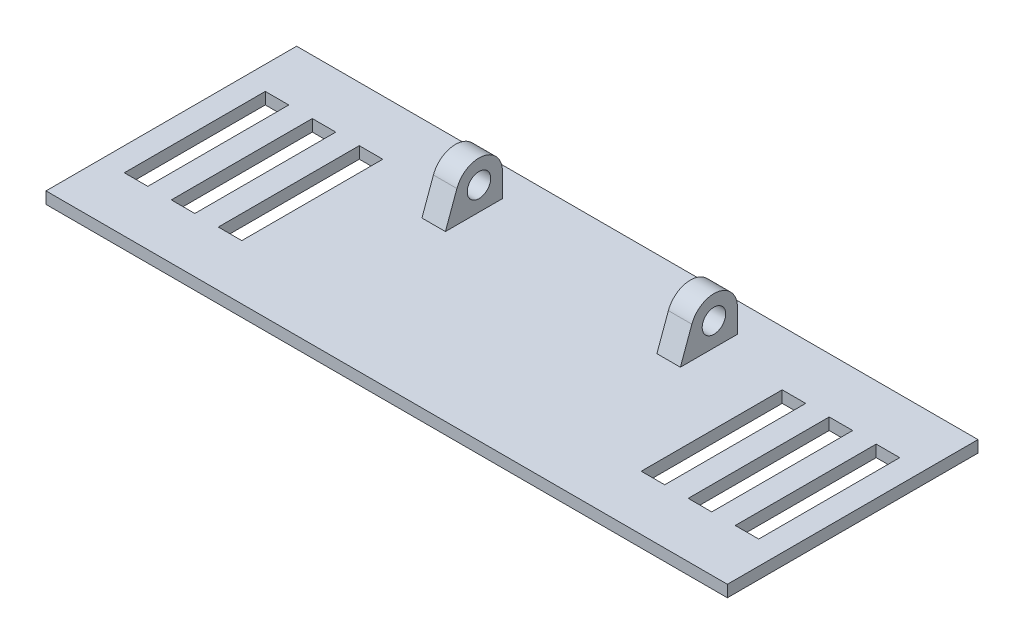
ISO-10303-21;
HEADER;
FILE_DESCRIPTION(('STEP AP214'),'2;1');
FILE_NAME('part.step','',(''),(''),'','','');
FILE_SCHEMA(('AUTOMOTIVE_DESIGN { 1 0 10303 214 1 1 1 1 }'));
ENDSEC;
DATA;
#1=APPLICATION_CONTEXT('core data for automotive mechanical design processes');
#2=APPLICATION_PROTOCOL_DEFINITION('international standard','automotive_design',2000,#1);
#3=PRODUCT_CONTEXT('',#1,'mechanical');
#4=PRODUCT('Part','Part','',(#3));
#5=PRODUCT_RELATED_PRODUCT_CATEGORY('part','',(#4));
#6=PRODUCT_DEFINITION_FORMATION('','',#4);
#7=PRODUCT_DEFINITION_CONTEXT('part definition',#1,'design');
#8=PRODUCT_DEFINITION('design','',#6,#7);
#9=PRODUCT_DEFINITION_SHAPE('','',#8);
#10=(LENGTH_UNIT() NAMED_UNIT(*) SI_UNIT(.MILLI.,.METRE.));
#11=(NAMED_UNIT(*) PLANE_ANGLE_UNIT() SI_UNIT($,.RADIAN.));
#12=(NAMED_UNIT(*) SI_UNIT($,.STERADIAN.) SOLID_ANGLE_UNIT());
#13=UNCERTAINTY_MEASURE_WITH_UNIT(LENGTH_MEASURE(1.E-05),#10,'distance_accuracy_value','');
#14=(GEOMETRIC_REPRESENTATION_CONTEXT(3) GLOBAL_UNCERTAINTY_ASSIGNED_CONTEXT((#13)) GLOBAL_UNIT_ASSIGNED_CONTEXT((#10,
#11,#12)) REPRESENTATION_CONTEXT('',''));
#15=CARTESIAN_POINT('',(0.,0.,0.));
#16=DIRECTION('',(0.,0.,1.));
#17=DIRECTION('',(1.,0.,0.));
#18=AXIS2_PLACEMENT_3D('',#15,#16,#17);
#19=CARTESIAN_POINT('',(13.5,21.5,-9.28381183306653));
#20=DIRECTION('',(-1.,0.,0.));
#21=DIRECTION('',(0.,0.,-1.));
#22=AXIS2_PLACEMENT_3D('',#19,#20,#21);
#23=PLANE('',#22);
#24=CARTESIAN_POINT('',(13.5,21.5,-9.28381183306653));
#25=DIRECTION('',(1.,0.,0.));
#26=DIRECTION('',(0.,0.,-1.));
#27=AXIS2_PLACEMENT_3D('',#24,#25,#26);
#28=CIRCLE('',#27,3.);
#29=CARTESIAN_POINT('',(13.5,21.5,-12.2838118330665));
#30=VERTEX_POINT('',#29);
#31=CARTESIAN_POINT('',(13.5,22.526060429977,-6.46473397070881));
#32=VERTEX_POINT('',#31);
#33=EDGE_CURVE('E274',#30,#32,#28,.T.);
#34=ORIENTED_EDGE('',*,*,#33,.F.);
#35=DIRECTION('',(0.,1.,0.));
#36=VECTOR('',#35,1.);
#37=CARTESIAN_POINT('',(13.5,21.5,-12.2838118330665));
#38=LINE('',#37,#36);
#39=CARTESIAN_POINT('',(13.5,18.5,-12.2838118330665));
#40=VERTEX_POINT('',#39);
#41=EDGE_CURVE('E286',#40,#30,#38,.T.);
#42=ORIENTED_EDGE('',*,*,#41,.F.);
#43=DIRECTION('',(0.,0.,-1.));
#44=VECTOR('',#43,1.);
#45=CARTESIAN_POINT('',(13.5,18.5,-4.99936781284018));
#46=LINE('',#45,#44);
#47=CARTESIAN_POINT('',(13.5,18.5,-4.99936781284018));
#48=VERTEX_POINT('',#47);
#49=EDGE_CURVE('E293',#48,#40,#46,.T.);
#50=ORIENTED_EDGE('',*,*,#49,.F.);
#51=DIRECTION('',(0.,-0.939692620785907,0.342020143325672));
#52=VECTOR('',#51,1.);
#53=CARTESIAN_POINT('',(13.5,22.526060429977,-6.46473397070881));
#54=LINE('',#53,#52);
#55=EDGE_CURVE('E289',#32,#48,#54,.T.);
#56=ORIENTED_EDGE('',*,*,#55,.F.);
#57=EDGE_LOOP('',(#34,#42,#50,#56));
#58=FACE_BOUND('',#57,.T.);
#59=CARTESIAN_POINT('',(13.5,21.5,-9.28381183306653));
#60=DIRECTION('',(1.,0.,0.));
#61=DIRECTION('',(0.,0.,-1.));
#62=AXIS2_PLACEMENT_3D('',#59,#60,#61);
#63=CIRCLE('',#62,1.5);
#64=CARTESIAN_POINT('',(13.5,21.5,-10.7838118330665));
#65=VERTEX_POINT('',#64);
#66=EDGE_CURVE('E302',#65,#65,#63,.T.);
#67=ORIENTED_EDGE('',*,*,#66,.T.);
#68=EDGE_LOOP('',(#67));
#69=FACE_BOUND('',#68,.T.);
#70=ADVANCED_FACE('F35',(#58,#69),#23,.T.);
#71=CARTESIAN_POINT('',(16.5,21.5,-9.28381183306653));
#72=DIRECTION('',(-1.,0.,0.));
#73=DIRECTION('',(0.,0.,-1.));
#74=AXIS2_PLACEMENT_3D('',#71,#72,#73);
#75=PLANE('',#74);
#76=CARTESIAN_POINT('',(16.5,21.5,-9.28381183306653));
#77=DIRECTION('',(1.,0.,0.));
#78=DIRECTION('',(0.,0.,-1.));
#79=AXIS2_PLACEMENT_3D('',#76,#77,#78);
#80=CIRCLE('',#79,3.);
#81=CARTESIAN_POINT('',(16.5,21.5,-12.2838118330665));
#82=VERTEX_POINT('',#81);
#83=CARTESIAN_POINT('',(16.5,22.526060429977,-6.46473397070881));
#84=VERTEX_POINT('',#83);
#85=EDGE_CURVE('E276',#82,#84,#80,.T.);
#86=ORIENTED_EDGE('',*,*,#85,.T.);
#87=DIRECTION('',(0.,-0.939692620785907,0.342020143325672));
#88=VECTOR('',#87,1.);
#89=CARTESIAN_POINT('',(16.5,22.526060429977,-6.46473397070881));
#90=LINE('',#89,#88);
#91=CARTESIAN_POINT('',(16.5,18.5,-4.99936781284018));
#92=VERTEX_POINT('',#91);
#93=EDGE_CURVE('E50',#84,#92,#90,.T.);
#94=ORIENTED_EDGE('',*,*,#93,.T.);
#95=DIRECTION('',(0.,0.,-1.));
#96=VECTOR('',#95,1.);
#97=CARTESIAN_POINT('',(16.5,18.5,-4.99936781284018));
#98=LINE('',#97,#96);
#99=CARTESIAN_POINT('',(16.5,18.5,-12.2838118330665));
#100=VERTEX_POINT('',#99);
#101=EDGE_CURVE('E304',#92,#100,#98,.T.);
#102=ORIENTED_EDGE('',*,*,#101,.T.);
#103=DIRECTION('',(0.,1.,0.));
#104=VECTOR('',#103,1.);
#105=CARTESIAN_POINT('',(16.5,21.5,-12.2838118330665));
#106=LINE('',#105,#104);
#107=EDGE_CURVE('E301',#100,#82,#106,.T.);
#108=ORIENTED_EDGE('',*,*,#107,.T.);
#109=EDGE_LOOP('',(#86,#94,#102,#108));
#110=FACE_BOUND('',#109,.T.);
#111=CARTESIAN_POINT('',(16.5,21.5,-9.28381183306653));
#112=DIRECTION('',(-1.,0.,0.));
#113=DIRECTION('',(0.,0.,1.));
#114=AXIS2_PLACEMENT_3D('',#111,#112,#113);
#115=CIRCLE('',#114,1.5);
#116=CARTESIAN_POINT('',(16.5,21.5,-7.78381183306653));
#117=VERTEX_POINT('',#116);
#118=EDGE_CURVE('E987',#117,#117,#115,.T.);
#119=ORIENTED_EDGE('',*,*,#118,.T.);
#120=EDGE_LOOP('',(#119));
#121=FACE_BOUND('',#120,.T.);
#122=ADVANCED_FACE('F588',(#110,#121),#75,.F.);
#123=CARTESIAN_POINT('',(0.,18.5,0.));
#124=DIRECTION('',(0.,1.,0.));
#125=DIRECTION('',(0.,0.,1.));
#126=AXIS2_PLACEMENT_3D('',#123,#124,#125);
#127=PLANE('',#126);
#128=ORIENTED_EDGE('',*,*,#49,.T.);
#129=DIRECTION('',(1.,0.,0.));
#130=VECTOR('',#129,1.);
#131=CARTESIAN_POINT('',(13.5,18.5,-12.2838118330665));
#132=LINE('',#131,#130);
#133=EDGE_CURVE('E281',#40,#100,#132,.T.);
#134=ORIENTED_EDGE('',*,*,#133,.T.);
#135=ORIENTED_EDGE('',*,*,#101,.F.);
#136=DIRECTION('',(1.,0.,0.));
#137=VECTOR('',#136,1.);
#138=CARTESIAN_POINT('',(13.5,18.5,-4.99936781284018));
#139=LINE('',#138,#137);
#140=EDGE_CURVE('E308',#48,#92,#139,.T.);
#141=ORIENTED_EDGE('',*,*,#140,.F.);
#142=EDGE_LOOP('',(#128,#134,#135,#141));
#143=FACE_BOUND('',#142,.T.);
#144=DIRECTION('',(0.,0.,-1.));
#145=VECTOR('',#144,1.);
#146=CARTESIAN_POINT('',(-13.5,18.5,-4.99936781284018));
#147=LINE('',#146,#145);
#148=CARTESIAN_POINT('',(-13.5,18.5,-4.99936781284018));
#149=VERTEX_POINT('',#148);
#150=CARTESIAN_POINT('',(-13.5,18.5,-12.2838118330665));
#151=VERTEX_POINT('',#150);
#152=EDGE_CURVE('E322',#149,#151,#147,.T.);
#153=ORIENTED_EDGE('',*,*,#152,.F.);
#154=DIRECTION('',(-1.,0.,0.));
#155=VECTOR('',#154,1.);
#156=CARTESIAN_POINT('',(-13.5,18.5,-4.99936781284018));
#157=LINE('',#156,#155);
#158=CARTESIAN_POINT('',(-16.5,18.5,-4.99936781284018));
#159=VERTEX_POINT('',#158);
#160=EDGE_CURVE('E339',#149,#159,#157,.T.);
#161=ORIENTED_EDGE('',*,*,#160,.T.);
#162=DIRECTION('',(0.,0.,-1.));
#163=VECTOR('',#162,1.);
#164=CARTESIAN_POINT('',(-16.5,18.5,-4.99936781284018));
#165=LINE('',#164,#163);
#166=CARTESIAN_POINT('',(-16.5,18.5,-12.2838118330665));
#167=VERTEX_POINT('',#166);
#168=EDGE_CURVE('E331',#159,#167,#165,.T.);
#169=ORIENTED_EDGE('',*,*,#168,.T.);
#170=DIRECTION('',(-1.,0.,0.));
#171=VECTOR('',#170,1.);
#172=CARTESIAN_POINT('',(-13.5,18.5,-12.2838118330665));
#173=LINE('',#172,#171);
#174=EDGE_CURVE('E337',#151,#167,#173,.T.);
#175=ORIENTED_EDGE('',*,*,#174,.F.);
#176=EDGE_LOOP('',(#153,#161,#169,#175));
#177=FACE_BOUND('',#176,.T.);
#178=DIRECTION('',(-1.,0.,0.));
#179=VECTOR('',#178,1.);
#180=CARTESIAN_POINT('',(34.5,18.5,9.));
#181=LINE('',#180,#179);
#182=CARTESIAN_POINT('',(34.5,18.5,9.));
#183=VERTEX_POINT('',#182);
#184=CARTESIAN_POINT('',(31.5,18.5,9.));
#185=VERTEX_POINT('',#184);
#186=EDGE_CURVE('E390',#183,#185,#181,.T.);
#187=ORIENTED_EDGE('',*,*,#186,.T.);
#188=DIRECTION('',(0.,0.,-1.));
#189=VECTOR('',#188,1.);
#190=CARTESIAN_POINT('',(31.5,18.5,-9.));
#191=LINE('',#190,#189);
#192=CARTESIAN_POINT('',(31.5,18.5,-9.));
#193=VERTEX_POINT('',#192);
#194=EDGE_CURVE('E370',#185,#193,#191,.T.);
#195=ORIENTED_EDGE('',*,*,#194,.T.);
#196=DIRECTION('',(1.,0.,0.));
#197=VECTOR('',#196,1.);
#198=CARTESIAN_POINT('',(34.5,18.5,-9.));
#199=LINE('',#198,#197);
#200=CARTESIAN_POINT('',(34.5,18.5,-9.));
#201=VERTEX_POINT('',#200);
#202=EDGE_CURVE('E380',#193,#201,#199,.T.);
#203=ORIENTED_EDGE('',*,*,#202,.T.);
#204=DIRECTION('',(0.,0.,1.));
#205=VECTOR('',#204,1.);
#206=CARTESIAN_POINT('',(34.5,18.5,-9.));
#207=LINE('',#206,#205);
#208=EDGE_CURVE('E393',#201,#183,#207,.T.);
#209=ORIENTED_EDGE('',*,*,#208,.T.);
#210=EDGE_LOOP('',(#187,#195,#203,#209));
#211=FACE_BOUND('',#210,.T.);
#212=DIRECTION('',(0.,0.,-1.));
#213=VECTOR('',#212,1.);
#214=CARTESIAN_POINT('',(43.5,18.5,16.));
#215=LINE('',#214,#213);
#216=CARTESIAN_POINT('',(43.5,18.5,16.));
#217=VERTEX_POINT('',#216);
#218=CARTESIAN_POINT('',(43.5,18.5,-16.));
#219=VERTEX_POINT('',#218);
#220=EDGE_CURVE('E535',#217,#219,#215,.T.);
#221=ORIENTED_EDGE('',*,*,#220,.T.);
#222=DIRECTION('',(-1.,0.,0.));
#223=VECTOR('',#222,1.);
#224=CARTESIAN_POINT('',(43.5,18.5,-16.));
#225=LINE('',#224,#223);
#226=CARTESIAN_POINT('',(-43.5,18.5,-16.));
#227=VERTEX_POINT('',#226);
#228=EDGE_CURVE('E538',#219,#227,#225,.T.);
#229=ORIENTED_EDGE('',*,*,#228,.T.);
#230=DIRECTION('',(0.,0.,1.));
#231=VECTOR('',#230,1.);
#232=CARTESIAN_POINT('',(-43.5,18.5,-16.));
#233=LINE('',#232,#231);
#234=CARTESIAN_POINT('',(-43.5,18.5,16.));
#235=VERTEX_POINT('',#234);
#236=EDGE_CURVE('E541',#227,#235,#233,.T.);
#237=ORIENTED_EDGE('',*,*,#236,.T.);
#238=DIRECTION('',(1.,0.,0.));
#239=VECTOR('',#238,1.);
#240=CARTESIAN_POINT('',(-43.5,18.5,16.));
#241=LINE('',#240,#239);
#242=EDGE_CURVE('E543',#235,#217,#241,.T.);
#243=ORIENTED_EDGE('',*,*,#242,.T.);
#244=EDGE_LOOP('',(#221,#229,#237,#243));
#245=FACE_BOUND('',#244,.T.);
#246=DIRECTION('',(0.,0.,-1.));
#247=VECTOR('',#246,1.);
#248=CARTESIAN_POINT('',(-37.5,18.5,-9.));
#249=LINE('',#248,#247);
#250=CARTESIAN_POINT('',(-37.5,18.5,9.));
#251=VERTEX_POINT('',#250);
#252=CARTESIAN_POINT('',(-37.5,18.5,-9.));
#253=VERTEX_POINT('',#252);
#254=EDGE_CURVE('E496',#251,#253,#249,.T.);
#255=ORIENTED_EDGE('',*,*,#254,.F.);
#256=DIRECTION('',(1.,0.,0.));
#257=VECTOR('',#256,1.);
#258=CARTESIAN_POINT('',(-40.5,18.5,9.));
#259=LINE('',#258,#257);
#260=CARTESIAN_POINT('',(-40.5,18.5,9.));
#261=VERTEX_POINT('',#260);
#262=EDGE_CURVE('E507',#261,#251,#259,.T.);
#263=ORIENTED_EDGE('',*,*,#262,.F.);
#264=DIRECTION('',(0.,0.,1.));
#265=VECTOR('',#264,1.);
#266=CARTESIAN_POINT('',(-40.5,18.5,-9.));
#267=LINE('',#266,#265);
#268=CARTESIAN_POINT('',(-40.5,18.5,-9.));
#269=VERTEX_POINT('',#268);
#270=EDGE_CURVE('E521',#269,#261,#267,.T.);
#271=ORIENTED_EDGE('',*,*,#270,.F.);
#272=DIRECTION('',(-1.,0.,0.));
#273=VECTOR('',#272,1.);
#274=CARTESIAN_POINT('',(-40.5,18.5,-9.));
#275=LINE('',#274,#273);
#276=EDGE_CURVE('E518',#253,#269,#275,.T.);
#277=ORIENTED_EDGE('',*,*,#276,.F.);
#278=EDGE_LOOP('',(#255,#263,#271,#277));
#279=FACE_BOUND('',#278,.T.);
#280=DIRECTION('',(0.,0.,-1.));
#281=VECTOR('',#280,1.);
#282=CARTESIAN_POINT('',(-31.5,18.5,-9.));
#283=LINE('',#282,#281);
#284=CARTESIAN_POINT('',(-31.5,18.5,9.));
#285=VERTEX_POINT('',#284);
#286=CARTESIAN_POINT('',(-31.5,18.5,-9.));
#287=VERTEX_POINT('',#286);
#288=EDGE_CURVE('E464',#285,#287,#283,.T.);
#289=ORIENTED_EDGE('',*,*,#288,.F.);
#290=DIRECTION('',(1.,0.,0.));
#291=VECTOR('',#290,1.);
#292=CARTESIAN_POINT('',(-34.5,18.5,9.));
#293=LINE('',#292,#291);
#294=CARTESIAN_POINT('',(-34.5,18.5,9.));
#295=VERTEX_POINT('',#294);
#296=EDGE_CURVE('E475',#295,#285,#293,.T.);
#297=ORIENTED_EDGE('',*,*,#296,.F.);
#298=DIRECTION('',(0.,0.,1.));
#299=VECTOR('',#298,1.);
#300=CARTESIAN_POINT('',(-34.5,18.5,-9.));
#301=LINE('',#300,#299);
#302=CARTESIAN_POINT('',(-34.5,18.5,-9.));
#303=VERTEX_POINT('',#302);
#304=EDGE_CURVE('E489',#303,#295,#301,.T.);
#305=ORIENTED_EDGE('',*,*,#304,.F.);
#306=DIRECTION('',(-1.,0.,0.));
#307=VECTOR('',#306,1.);
#308=CARTESIAN_POINT('',(-34.5,18.5,-9.));
#309=LINE('',#308,#307);
#310=EDGE_CURVE('E486',#287,#303,#309,.T.);
#311=ORIENTED_EDGE('',*,*,#310,.F.);
#312=EDGE_LOOP('',(#289,#297,#305,#311));
#313=FACE_BOUND('',#312,.T.);
#314=DIRECTION('',(0.,0.,-1.));
#315=VECTOR('',#314,1.);
#316=CARTESIAN_POINT('',(-25.5,18.5,-9.));
#317=LINE('',#316,#315);
#318=CARTESIAN_POINT('',(-25.5,18.5,9.));
#319=VERTEX_POINT('',#318);
#320=CARTESIAN_POINT('',(-25.5,18.5,-9.));
#321=VERTEX_POINT('',#320);
#322=EDGE_CURVE('E432',#319,#321,#317,.T.);
#323=ORIENTED_EDGE('',*,*,#322,.F.);
#324=DIRECTION('',(1.,0.,0.));
#325=VECTOR('',#324,1.);
#326=CARTESIAN_POINT('',(-28.5,18.5,9.));
#327=LINE('',#326,#325);
#328=CARTESIAN_POINT('',(-28.5,18.5,9.));
#329=VERTEX_POINT('',#328);
#330=EDGE_CURVE('E443',#329,#319,#327,.T.);
#331=ORIENTED_EDGE('',*,*,#330,.F.);
#332=DIRECTION('',(0.,0.,1.));
#333=VECTOR('',#332,1.);
#334=CARTESIAN_POINT('',(-28.5,18.5,-9.));
#335=LINE('',#334,#333);
#336=CARTESIAN_POINT('',(-28.5,18.5,-9.));
#337=VERTEX_POINT('',#336);
#338=EDGE_CURVE('E457',#337,#329,#335,.T.);
#339=ORIENTED_EDGE('',*,*,#338,.F.);
#340=DIRECTION('',(-1.,0.,0.));
#341=VECTOR('',#340,1.);
#342=CARTESIAN_POINT('',(-28.5,18.5,-9.));
#343=LINE('',#342,#341);
#344=EDGE_CURVE('E454',#321,#337,#343,.T.);
#345=ORIENTED_EDGE('',*,*,#344,.F.);
#346=EDGE_LOOP('',(#323,#331,#339,#345));
#347=FACE_BOUND('',#346,.T.);
#348=DIRECTION('',(-1.,0.,0.));
#349=VECTOR('',#348,1.);
#350=CARTESIAN_POINT('',(40.5,18.5,9.));
#351=LINE('',#350,#349);
#352=CARTESIAN_POINT('',(40.5,18.5,9.));
#353=VERTEX_POINT('',#352);
#354=CARTESIAN_POINT('',(37.5,18.5,9.));
#355=VERTEX_POINT('',#354);
#356=EDGE_CURVE('E421',#353,#355,#351,.T.);
#357=ORIENTED_EDGE('',*,*,#356,.T.);
#358=DIRECTION('',(0.,0.,-1.));
#359=VECTOR('',#358,1.);
#360=CARTESIAN_POINT('',(37.5,18.5,-9.));
#361=LINE('',#360,#359);
#362=CARTESIAN_POINT('',(37.5,18.5,-9.));
#363=VERTEX_POINT('',#362);
#364=EDGE_CURVE('E401',#355,#363,#361,.T.);
#365=ORIENTED_EDGE('',*,*,#364,.T.);
#366=DIRECTION('',(1.,0.,0.));
#367=VECTOR('',#366,1.);
#368=CARTESIAN_POINT('',(40.5,18.5,-9.));
#369=LINE('',#368,#367);
#370=CARTESIAN_POINT('',(40.5,18.5,-9.));
#371=VERTEX_POINT('',#370);
#372=EDGE_CURVE('E411',#363,#371,#369,.T.);
#373=ORIENTED_EDGE('',*,*,#372,.T.);
#374=DIRECTION('',(0.,0.,1.));
#375=VECTOR('',#374,1.);
#376=CARTESIAN_POINT('',(40.5,18.5,-9.));
#377=LINE('',#376,#375);
#378=EDGE_CURVE('E424',#371,#353,#377,.T.);
#379=ORIENTED_EDGE('',*,*,#378,.T.);
#380=EDGE_LOOP('',(#357,#365,#373,#379));
#381=FACE_BOUND('',#380,.T.);
#382=DIRECTION('',(-1.,0.,0.));
#383=VECTOR('',#382,1.);
#384=CARTESIAN_POINT('',(28.5,18.5,9.));
#385=LINE('',#384,#383);
#386=CARTESIAN_POINT('',(28.5,18.5,9.));
#387=VERTEX_POINT('',#386);
#388=CARTESIAN_POINT('',(25.5,18.5,9.));
#389=VERTEX_POINT('',#388);
#390=EDGE_CURVE('E359',#387,#389,#385,.T.);
#391=ORIENTED_EDGE('',*,*,#390,.T.);
#392=DIRECTION('',(0.,0.,-1.));
#393=VECTOR('',#392,1.);
#394=CARTESIAN_POINT('',(25.5,18.5,-9.));
#395=LINE('',#394,#393);
#396=CARTESIAN_POINT('',(25.5,18.5,-9.));
#397=VERTEX_POINT('',#396);
#398=EDGE_CURVE('E345',#389,#397,#395,.T.);
#399=ORIENTED_EDGE('',*,*,#398,.T.);
#400=DIRECTION('',(1.,0.,0.));
#401=VECTOR('',#400,1.);
#402=CARTESIAN_POINT('',(28.5,18.5,-9.));
#403=LINE('',#402,#401);
#404=CARTESIAN_POINT('',(28.5,18.5,-9.));
#405=VERTEX_POINT('',#404);
#406=EDGE_CURVE('E349',#397,#405,#403,.T.);
#407=ORIENTED_EDGE('',*,*,#406,.T.);
#408=DIRECTION('',(0.,0.,1.));
#409=VECTOR('',#408,1.);
#410=CARTESIAN_POINT('',(28.5,18.5,-9.));
#411=LINE('',#410,#409);
#412=EDGE_CURVE('E362',#405,#387,#411,.T.);
#413=ORIENTED_EDGE('',*,*,#412,.T.);
#414=EDGE_LOOP('',(#391,#399,#407,#413));
#415=FACE_BOUND('',#414,.T.);
#416=ADVANCED_FACE('F578',(#143,#177,#211,#245,#279,#313,#347,#381,#415),#127,.T.);
#417=CARTESIAN_POINT('',(0.,17.,0.));
#418=DIRECTION('',(0.,1.,0.));
#419=DIRECTION('',(0.,0.,1.));
#420=AXIS2_PLACEMENT_3D('',#417,#418,#419);
#421=PLANE('',#420);
#422=DIRECTION('',(0.,0.,-1.));
#423=VECTOR('',#422,1.);
#424=CARTESIAN_POINT('',(31.5,17.,-9.));
#425=LINE('',#424,#423);
#426=CARTESIAN_POINT('',(31.5,17.,9.));
#427=VERTEX_POINT('',#426);
#428=CARTESIAN_POINT('',(31.5,17.,-9.));
#429=VERTEX_POINT('',#428);
#430=EDGE_CURVE('E377',#427,#429,#425,.T.);
#431=ORIENTED_EDGE('',*,*,#430,.F.);
#432=DIRECTION('',(-1.,0.,0.));
#433=VECTOR('',#432,1.);
#434=CARTESIAN_POINT('',(34.5,17.,9.));
#435=LINE('',#434,#433);
#436=CARTESIAN_POINT('',(34.5,17.,9.));
#437=VERTEX_POINT('',#436);
#438=EDGE_CURVE('E379',#437,#427,#435,.T.);
#439=ORIENTED_EDGE('',*,*,#438,.F.);
#440=DIRECTION('',(0.,0.,1.));
#441=VECTOR('',#440,1.);
#442=CARTESIAN_POINT('',(34.5,17.,-9.));
#443=LINE('',#442,#441);
#444=CARTESIAN_POINT('',(34.5,17.,-9.));
#445=VERTEX_POINT('',#444);
#446=EDGE_CURVE('E382',#445,#437,#443,.T.);
#447=ORIENTED_EDGE('',*,*,#446,.F.);
#448=DIRECTION('',(1.,0.,0.));
#449=VECTOR('',#448,1.);
#450=CARTESIAN_POINT('',(34.5,17.,-9.));
#451=LINE('',#450,#449);
#452=EDGE_CURVE('E385',#429,#445,#451,.T.);
#453=ORIENTED_EDGE('',*,*,#452,.F.);
#454=EDGE_LOOP('',(#431,#439,#447,#453));
#455=FACE_BOUND('',#454,.T.);
#456=DIRECTION('',(0.,0.,-1.));
#457=VECTOR('',#456,1.);
#458=CARTESIAN_POINT('',(43.5,17.,16.));
#459=LINE('',#458,#457);
#460=CARTESIAN_POINT('',(43.5,17.,16.));
#461=VERTEX_POINT('',#460);
#462=CARTESIAN_POINT('',(43.5,17.,-16.));
#463=VERTEX_POINT('',#462);
#464=EDGE_CURVE('E528',#461,#463,#459,.T.);
#465=ORIENTED_EDGE('',*,*,#464,.F.);
#466=DIRECTION('',(1.,0.,0.));
#467=VECTOR('',#466,1.);
#468=CARTESIAN_POINT('',(-43.5,17.,16.));
#469=LINE('',#468,#467);
#470=CARTESIAN_POINT('',(-43.5,17.,16.));
#471=VERTEX_POINT('',#470);
#472=EDGE_CURVE('E539',#471,#461,#469,.T.);
#473=ORIENTED_EDGE('',*,*,#472,.F.);
#474=DIRECTION('',(0.,0.,1.));
#475=VECTOR('',#474,1.);
#476=CARTESIAN_POINT('',(-43.5,17.,-16.));
#477=LINE('',#476,#475);
#478=CARTESIAN_POINT('',(-43.5,17.,-16.));
#479=VERTEX_POINT('',#478);
#480=EDGE_CURVE('E550',#479,#471,#477,.T.);
#481=ORIENTED_EDGE('',*,*,#480,.F.);
#482=DIRECTION('',(-1.,0.,0.));
#483=VECTOR('',#482,1.);
#484=CARTESIAN_POINT('',(43.5,17.,-16.));
#485=LINE('',#484,#483);
#486=EDGE_CURVE('E548',#463,#479,#485,.T.);
#487=ORIENTED_EDGE('',*,*,#486,.F.);
#488=EDGE_LOOP('',(#465,#473,#481,#487));
#489=FACE_BOUND('',#488,.T.);
#490=DIRECTION('',(1.,0.,0.));
#491=VECTOR('',#490,1.);
#492=CARTESIAN_POINT('',(-40.5,17.,9.));
#493=LINE('',#492,#491);
#494=CARTESIAN_POINT('',(-40.5,17.,9.));
#495=VERTEX_POINT('',#494);
#496=CARTESIAN_POINT('',(-37.5,17.,9.));
#497=VERTEX_POINT('',#496);
#498=EDGE_CURVE('E513',#495,#497,#493,.T.);
#499=ORIENTED_EDGE('',*,*,#498,.T.);
#500=DIRECTION('',(0.,0.,-1.));
#501=VECTOR('',#500,1.);
#502=CARTESIAN_POINT('',(-37.5,17.,-9.));
#503=LINE('',#502,#501);
#504=CARTESIAN_POINT('',(-37.5,17.,-9.));
#505=VERTEX_POINT('',#504);
#506=EDGE_CURVE('E503',#497,#505,#503,.T.);
#507=ORIENTED_EDGE('',*,*,#506,.T.);
#508=DIRECTION('',(-1.,0.,0.));
#509=VECTOR('',#508,1.);
#510=CARTESIAN_POINT('',(-40.5,17.,-9.));
#511=LINE('',#510,#509);
#512=CARTESIAN_POINT('',(-40.5,17.,-9.));
#513=VERTEX_POINT('',#512);
#514=EDGE_CURVE('E506',#505,#513,#511,.T.);
#515=ORIENTED_EDGE('',*,*,#514,.T.);
#516=DIRECTION('',(0.,0.,1.));
#517=VECTOR('',#516,1.);
#518=CARTESIAN_POINT('',(-40.5,17.,-9.));
#519=LINE('',#518,#517);
#520=EDGE_CURVE('E510',#513,#495,#519,.T.);
#521=ORIENTED_EDGE('',*,*,#520,.T.);
#522=EDGE_LOOP('',(#499,#507,#515,#521));
#523=FACE_BOUND('',#522,.T.);
#524=DIRECTION('',(1.,0.,0.));
#525=VECTOR('',#524,1.);
#526=CARTESIAN_POINT('',(-34.5,17.,9.));
#527=LINE('',#526,#525);
#528=CARTESIAN_POINT('',(-34.5,17.,9.));
#529=VERTEX_POINT('',#528);
#530=CARTESIAN_POINT('',(-31.5,17.,9.));
#531=VERTEX_POINT('',#530);
#532=EDGE_CURVE('E481',#529,#531,#527,.T.);
#533=ORIENTED_EDGE('',*,*,#532,.T.);
#534=DIRECTION('',(0.,0.,-1.));
#535=VECTOR('',#534,1.);
#536=CARTESIAN_POINT('',(-31.5,17.,-9.));
#537=LINE('',#536,#535);
#538=CARTESIAN_POINT('',(-31.5,17.,-9.));
#539=VERTEX_POINT('',#538);
#540=EDGE_CURVE('E471',#531,#539,#537,.T.);
#541=ORIENTED_EDGE('',*,*,#540,.T.);
#542=DIRECTION('',(-1.,0.,0.));
#543=VECTOR('',#542,1.);
#544=CARTESIAN_POINT('',(-34.5,17.,-9.));
#545=LINE('',#544,#543);
#546=CARTESIAN_POINT('',(-34.5,17.,-9.));
#547=VERTEX_POINT('',#546);
#548=EDGE_CURVE('E474',#539,#547,#545,.T.);
#549=ORIENTED_EDGE('',*,*,#548,.T.);
#550=DIRECTION('',(0.,0.,1.));
#551=VECTOR('',#550,1.);
#552=CARTESIAN_POINT('',(-34.5,17.,-9.));
#553=LINE('',#552,#551);
#554=EDGE_CURVE('E478',#547,#529,#553,.T.);
#555=ORIENTED_EDGE('',*,*,#554,.T.);
#556=EDGE_LOOP('',(#533,#541,#549,#555));
#557=FACE_BOUND('',#556,.T.);
#558=DIRECTION('',(1.,0.,0.));
#559=VECTOR('',#558,1.);
#560=CARTESIAN_POINT('',(-28.5,17.,9.));
#561=LINE('',#560,#559);
#562=CARTESIAN_POINT('',(-28.5,17.,9.));
#563=VERTEX_POINT('',#562);
#564=CARTESIAN_POINT('',(-25.5,17.,9.));
#565=VERTEX_POINT('',#564);
#566=EDGE_CURVE('E449',#563,#565,#561,.T.);
#567=ORIENTED_EDGE('',*,*,#566,.T.);
#568=DIRECTION('',(0.,0.,-1.));
#569=VECTOR('',#568,1.);
#570=CARTESIAN_POINT('',(-25.5,17.,-9.));
#571=LINE('',#570,#569);
#572=CARTESIAN_POINT('',(-25.5,17.,-9.));
#573=VERTEX_POINT('',#572);
#574=EDGE_CURVE('E439',#565,#573,#571,.T.);
#575=ORIENTED_EDGE('',*,*,#574,.T.);
#576=DIRECTION('',(-1.,0.,0.));
#577=VECTOR('',#576,1.);
#578=CARTESIAN_POINT('',(-28.5,17.,-9.));
#579=LINE('',#578,#577);
#580=CARTESIAN_POINT('',(-28.5,17.,-9.));
#581=VERTEX_POINT('',#580);
#582=EDGE_CURVE('E442',#573,#581,#579,.T.);
#583=ORIENTED_EDGE('',*,*,#582,.T.);
#584=DIRECTION('',(0.,0.,1.));
#585=VECTOR('',#584,1.);
#586=CARTESIAN_POINT('',(-28.5,17.,-9.));
#587=LINE('',#586,#585);
#588=EDGE_CURVE('E446',#581,#563,#587,.T.);
#589=ORIENTED_EDGE('',*,*,#588,.T.);
#590=EDGE_LOOP('',(#567,#575,#583,#589));
#591=FACE_BOUND('',#590,.T.);
#592=DIRECTION('',(0.,0.,-1.));
#593=VECTOR('',#592,1.);
#594=CARTESIAN_POINT('',(37.5,17.,-9.));
#595=LINE('',#594,#593);
#596=CARTESIAN_POINT('',(37.5,17.,9.));
#597=VERTEX_POINT('',#596);
#598=CARTESIAN_POINT('',(37.5,17.,-9.));
#599=VERTEX_POINT('',#598);
#600=EDGE_CURVE('E408',#597,#599,#595,.T.);
#601=ORIENTED_EDGE('',*,*,#600,.F.);
#602=DIRECTION('',(-1.,0.,0.));
#603=VECTOR('',#602,1.);
#604=CARTESIAN_POINT('',(40.5,17.,9.));
#605=LINE('',#604,#603);
#606=CARTESIAN_POINT('',(40.5,17.,9.));
#607=VERTEX_POINT('',#606);
#608=EDGE_CURVE('E410',#607,#597,#605,.T.);
#609=ORIENTED_EDGE('',*,*,#608,.F.);
#610=DIRECTION('',(0.,0.,1.));
#611=VECTOR('',#610,1.);
#612=CARTESIAN_POINT('',(40.5,17.,-9.));
#613=LINE('',#612,#611);
#614=CARTESIAN_POINT('',(40.5,17.,-9.));
#615=VERTEX_POINT('',#614);
#616=EDGE_CURVE('E413',#615,#607,#613,.T.);
#617=ORIENTED_EDGE('',*,*,#616,.F.);
#618=DIRECTION('',(1.,0.,0.));
#619=VECTOR('',#618,1.);
#620=CARTESIAN_POINT('',(40.5,17.,-9.));
#621=LINE('',#620,#619);
#622=EDGE_CURVE('E416',#599,#615,#621,.T.);
#623=ORIENTED_EDGE('',*,*,#622,.F.);
#624=EDGE_LOOP('',(#601,#609,#617,#623));
#625=FACE_BOUND('',#624,.T.);
#626=DIRECTION('',(0.,0.,-1.));
#627=VECTOR('',#626,1.);
#628=CARTESIAN_POINT('',(25.5,17.,-9.));
#629=LINE('',#628,#627);
#630=CARTESIAN_POINT('',(25.5,17.,9.));
#631=VERTEX_POINT('',#630);
#632=CARTESIAN_POINT('',(25.5,17.,-9.));
#633=VERTEX_POINT('',#632);
#634=EDGE_CURVE('E346',#631,#633,#629,.T.);
#635=ORIENTED_EDGE('',*,*,#634,.F.);
#636=DIRECTION('',(-1.,0.,0.));
#637=VECTOR('',#636,1.);
#638=CARTESIAN_POINT('',(28.5,17.,9.));
#639=LINE('',#638,#637);
#640=CARTESIAN_POINT('',(28.5,17.,9.));
#641=VERTEX_POINT('',#640);
#642=EDGE_CURVE('E348',#641,#631,#639,.T.);
#643=ORIENTED_EDGE('',*,*,#642,.F.);
#644=DIRECTION('',(0.,0.,1.));
#645=VECTOR('',#644,1.);
#646=CARTESIAN_POINT('',(28.5,17.,-9.));
#647=LINE('',#646,#645);
#648=CARTESIAN_POINT('',(28.5,17.,-9.));
#649=VERTEX_POINT('',#648);
#650=EDGE_CURVE('E351',#649,#641,#647,.T.);
#651=ORIENTED_EDGE('',*,*,#650,.F.);
#652=DIRECTION('',(1.,0.,0.));
#653=VECTOR('',#652,1.);
#654=CARTESIAN_POINT('',(28.5,17.,-9.));
#655=LINE('',#654,#653);
#656=EDGE_CURVE('E354',#633,#649,#655,.T.);
#657=ORIENTED_EDGE('',*,*,#656,.F.);
#658=EDGE_LOOP('',(#635,#643,#651,#657));
#659=FACE_BOUND('',#658,.T.);
#660=ADVANCED_FACE('F568',(#455,#489,#523,#557,#591,#625,#659),#421,.F.);
#661=CARTESIAN_POINT('',(43.5,18.5,16.));
#662=DIRECTION('',(-1.,0.,0.));
#663=DIRECTION('',(0.,0.,1.));
#664=AXIS2_PLACEMENT_3D('',#661,#662,#663);
#665=PLANE('',#664);
#666=ORIENTED_EDGE('',*,*,#464,.T.);
#667=DIRECTION('',(0.,-1.,0.));
#668=VECTOR('',#667,1.);
#669=CARTESIAN_POINT('',(43.5,18.5,-16.));
#670=LINE('',#669,#668);
#671=EDGE_CURVE('E11',#219,#463,#670,.T.);
#672=ORIENTED_EDGE('',*,*,#671,.F.);
#673=ORIENTED_EDGE('',*,*,#220,.F.);
#674=DIRECTION('',(0.,-1.,0.));
#675=VECTOR('',#674,1.);
#676=CARTESIAN_POINT('',(43.5,18.5,16.));
#677=LINE('',#676,#675);
#678=EDGE_CURVE('E545',#217,#461,#677,.T.);
#679=ORIENTED_EDGE('',*,*,#678,.T.);
#680=EDGE_LOOP('',(#666,#672,#673,#679));
#681=FACE_BOUND('',#680,.T.);
#682=ADVANCED_FACE('F37',(#681),#665,.F.);
#683=CARTESIAN_POINT('',(43.5,18.5,-16.));
#684=DIRECTION('',(0.,0.,1.));
#685=DIRECTION('',(1.,0.,0.));
#686=AXIS2_PLACEMENT_3D('',#683,#684,#685);
#687=PLANE('',#686);
#688=ORIENTED_EDGE('',*,*,#486,.T.);
#689=DIRECTION('',(0.,-1.,0.));
#690=VECTOR('',#689,1.);
#691=CARTESIAN_POINT('',(-43.5,18.5,-16.));
#692=LINE('',#691,#690);
#693=EDGE_CURVE('E43',#227,#479,#692,.T.);
#694=ORIENTED_EDGE('',*,*,#693,.F.);
#695=ORIENTED_EDGE('',*,*,#228,.F.);
#696=ORIENTED_EDGE('',*,*,#671,.T.);
#697=EDGE_LOOP('',(#688,#694,#695,#696));
#698=FACE_BOUND('',#697,.T.);
#699=ADVANCED_FACE('F580',(#698),#687,.F.);
#700=CARTESIAN_POINT('',(-43.5,18.5,-16.));
#701=DIRECTION('',(1.,0.,0.));
#702=DIRECTION('',(0.,0.,-1.));
#703=AXIS2_PLACEMENT_3D('',#700,#701,#702);
#704=PLANE('',#703);
#705=ORIENTED_EDGE('',*,*,#480,.T.);
#706=DIRECTION('',(0.,-1.,0.));
#707=VECTOR('',#706,1.);
#708=CARTESIAN_POINT('',(-43.5,18.5,16.));
#709=LINE('',#708,#707);
#710=EDGE_CURVE('E555',#235,#471,#709,.T.);
#711=ORIENTED_EDGE('',*,*,#710,.F.);
#712=ORIENTED_EDGE('',*,*,#236,.F.);
#713=ORIENTED_EDGE('',*,*,#693,.T.);
#714=EDGE_LOOP('',(#705,#711,#712,#713));
#715=FACE_BOUND('',#714,.T.);
#716=ADVANCED_FACE('F562',(#715),#704,.F.);
#717=CARTESIAN_POINT('',(-43.5,18.5,16.));
#718=DIRECTION('',(0.,0.,-1.));
#719=DIRECTION('',(-1.,0.,0.));
#720=AXIS2_PLACEMENT_3D('',#717,#718,#719);
#721=PLANE('',#720);
#722=ORIENTED_EDGE('',*,*,#472,.T.);
#723=ORIENTED_EDGE('',*,*,#678,.F.);
#724=ORIENTED_EDGE('',*,*,#242,.F.);
#725=ORIENTED_EDGE('',*,*,#710,.T.);
#726=EDGE_LOOP('',(#722,#723,#724,#725));
#727=FACE_BOUND('',#726,.T.);
#728=ADVANCED_FACE('F572',(#727),#721,.F.);
#729=CARTESIAN_POINT('',(-37.5,17.,-9.));
#730=DIRECTION('',(1.,0.,0.));
#731=DIRECTION('',(0.,0.,-1.));
#732=AXIS2_PLACEMENT_3D('',#729,#730,#731);
#733=PLANE('',#732);
#734=ORIENTED_EDGE('',*,*,#254,.T.);
#735=DIRECTION('',(0.,1.,0.));
#736=VECTOR('',#735,1.);
#737=CARTESIAN_POINT('',(-37.5,17.,-9.));
#738=LINE('',#737,#736);
#739=EDGE_CURVE('E516',#505,#253,#738,.T.);
#740=ORIENTED_EDGE('',*,*,#739,.F.);
#741=ORIENTED_EDGE('',*,*,#506,.F.);
#742=DIRECTION('',(0.,1.,0.));
#743=VECTOR('',#742,1.);
#744=CARTESIAN_POINT('',(-37.5,17.,9.));
#745=LINE('',#744,#743);
#746=EDGE_CURVE('E526',#497,#251,#745,.T.);
#747=ORIENTED_EDGE('',*,*,#746,.T.);
#748=EDGE_LOOP('',(#734,#740,#741,#747));
#749=FACE_BOUND('',#748,.T.);
#750=ADVANCED_FACE('F714',(#749),#733,.F.);
#751=CARTESIAN_POINT('',(-40.5,17.,9.));
#752=DIRECTION('',(0.,0.,1.));
#753=DIRECTION('',(1.,0.,0.));
#754=AXIS2_PLACEMENT_3D('',#751,#752,#753);
#755=PLANE('',#754);
#756=ORIENTED_EDGE('',*,*,#262,.T.);
#757=ORIENTED_EDGE('',*,*,#746,.F.);
#758=ORIENTED_EDGE('',*,*,#498,.F.);
#759=DIRECTION('',(0.,1.,0.));
#760=VECTOR('',#759,1.);
#761=CARTESIAN_POINT('',(-40.5,17.,9.));
#762=LINE('',#761,#760);
#763=EDGE_CURVE('E529',#495,#261,#762,.T.);
#764=ORIENTED_EDGE('',*,*,#763,.T.);
#765=EDGE_LOOP('',(#756,#757,#758,#764));
#766=FACE_BOUND('',#765,.T.);
#767=ADVANCED_FACE('F710',(#766),#755,.F.);
#768=CARTESIAN_POINT('',(-40.5,17.,-9.));
#769=DIRECTION('',(-1.,0.,0.));
#770=DIRECTION('',(0.,0.,1.));
#771=AXIS2_PLACEMENT_3D('',#768,#769,#770);
#772=PLANE('',#771);
#773=ORIENTED_EDGE('',*,*,#270,.T.);
#774=ORIENTED_EDGE('',*,*,#763,.F.);
#775=ORIENTED_EDGE('',*,*,#520,.F.);
#776=DIRECTION('',(0.,1.,0.));
#777=VECTOR('',#776,1.);
#778=CARTESIAN_POINT('',(-40.5,17.,-9.));
#779=LINE('',#778,#777);
#780=EDGE_CURVE('E531',#513,#269,#779,.T.);
#781=ORIENTED_EDGE('',*,*,#780,.T.);
#782=EDGE_LOOP('',(#773,#774,#775,#781));
#783=FACE_BOUND('',#782,.T.);
#784=ADVANCED_FACE('F713',(#783),#772,.F.);
#785=CARTESIAN_POINT('',(-40.5,17.,-9.));
#786=DIRECTION('',(0.,0.,-1.));
#787=DIRECTION('',(-1.,0.,0.));
#788=AXIS2_PLACEMENT_3D('',#785,#786,#787);
#789=PLANE('',#788);
#790=ORIENTED_EDGE('',*,*,#276,.T.);
#791=ORIENTED_EDGE('',*,*,#780,.F.);
#792=ORIENTED_EDGE('',*,*,#514,.F.);
#793=ORIENTED_EDGE('',*,*,#739,.T.);
#794=EDGE_LOOP('',(#790,#791,#792,#793));
#795=FACE_BOUND('',#794,.T.);
#796=ADVANCED_FACE('F708',(#795),#789,.F.);
#797=CARTESIAN_POINT('',(-31.5,17.,-9.));
#798=DIRECTION('',(1.,0.,0.));
#799=DIRECTION('',(0.,0.,-1.));
#800=AXIS2_PLACEMENT_3D('',#797,#798,#799);
#801=PLANE('',#800);
#802=ORIENTED_EDGE('',*,*,#288,.T.);
#803=DIRECTION('',(0.,1.,0.));
#804=VECTOR('',#803,1.);
#805=CARTESIAN_POINT('',(-31.5,17.,-9.));
#806=LINE('',#805,#804);
#807=EDGE_CURVE('E484',#539,#287,#806,.T.);
#808=ORIENTED_EDGE('',*,*,#807,.F.);
#809=ORIENTED_EDGE('',*,*,#540,.F.);
#810=DIRECTION('',(0.,1.,0.));
#811=VECTOR('',#810,1.);
#812=CARTESIAN_POINT('',(-31.5,17.,9.));
#813=LINE('',#812,#811);
#814=EDGE_CURVE('E494',#531,#285,#813,.T.);
#815=ORIENTED_EDGE('',*,*,#814,.T.);
#816=EDGE_LOOP('',(#802,#808,#809,#815));
#817=FACE_BOUND('',#816,.T.);
#818=ADVANCED_FACE('F698',(#817),#801,.F.);
#819=CARTESIAN_POINT('',(-34.5,17.,9.));
#820=DIRECTION('',(0.,0.,1.));
#821=DIRECTION('',(1.,0.,0.));
#822=AXIS2_PLACEMENT_3D('',#819,#820,#821);
#823=PLANE('',#822);
#824=ORIENTED_EDGE('',*,*,#296,.T.);
#825=ORIENTED_EDGE('',*,*,#814,.F.);
#826=ORIENTED_EDGE('',*,*,#532,.F.);
#827=DIRECTION('',(0.,1.,0.));
#828=VECTOR('',#827,1.);
#829=CARTESIAN_POINT('',(-34.5,17.,9.));
#830=LINE('',#829,#828);
#831=EDGE_CURVE('E497',#529,#295,#830,.T.);
#832=ORIENTED_EDGE('',*,*,#831,.T.);
#833=EDGE_LOOP('',(#824,#825,#826,#832));
#834=FACE_BOUND('',#833,.T.);
#835=ADVANCED_FACE('F694',(#834),#823,.F.);
#836=CARTESIAN_POINT('',(-34.5,17.,-9.));
#837=DIRECTION('',(-1.,0.,0.));
#838=DIRECTION('',(0.,0.,1.));
#839=AXIS2_PLACEMENT_3D('',#836,#837,#838);
#840=PLANE('',#839);
#841=ORIENTED_EDGE('',*,*,#304,.T.);
#842=ORIENTED_EDGE('',*,*,#831,.F.);
#843=ORIENTED_EDGE('',*,*,#554,.F.);
#844=DIRECTION('',(0.,1.,0.));
#845=VECTOR('',#844,1.);
#846=CARTESIAN_POINT('',(-34.5,17.,-9.));
#847=LINE('',#846,#845);
#848=EDGE_CURVE('E499',#547,#303,#847,.T.);
#849=ORIENTED_EDGE('',*,*,#848,.T.);
#850=EDGE_LOOP('',(#841,#842,#843,#849));
#851=FACE_BOUND('',#850,.T.);
#852=ADVANCED_FACE('F697',(#851),#840,.F.);
#853=CARTESIAN_POINT('',(-34.5,17.,-9.));
#854=DIRECTION('',(0.,0.,-1.));
#855=DIRECTION('',(-1.,0.,0.));
#856=AXIS2_PLACEMENT_3D('',#853,#854,#855);
#857=PLANE('',#856);
#858=ORIENTED_EDGE('',*,*,#310,.T.);
#859=ORIENTED_EDGE('',*,*,#848,.F.);
#860=ORIENTED_EDGE('',*,*,#548,.F.);
#861=ORIENTED_EDGE('',*,*,#807,.T.);
#862=EDGE_LOOP('',(#858,#859,#860,#861));
#863=FACE_BOUND('',#862,.T.);
#864=ADVANCED_FACE('F692',(#863),#857,.F.);
#865=CARTESIAN_POINT('',(-25.5,17.,-9.));
#866=DIRECTION('',(1.,0.,0.));
#867=DIRECTION('',(0.,0.,-1.));
#868=AXIS2_PLACEMENT_3D('',#865,#866,#867);
#869=PLANE('',#868);
#870=ORIENTED_EDGE('',*,*,#322,.T.);
#871=DIRECTION('',(0.,1.,0.));
#872=VECTOR('',#871,1.);
#873=CARTESIAN_POINT('',(-25.5,17.,-9.));
#874=LINE('',#873,#872);
#875=EDGE_CURVE('E452',#573,#321,#874,.T.);
#876=ORIENTED_EDGE('',*,*,#875,.F.);
#877=ORIENTED_EDGE('',*,*,#574,.F.);
#878=DIRECTION('',(0.,1.,0.));
#879=VECTOR('',#878,1.);
#880=CARTESIAN_POINT('',(-25.5,17.,9.));
#881=LINE('',#880,#879);
#882=EDGE_CURVE('E462',#565,#319,#881,.T.);
#883=ORIENTED_EDGE('',*,*,#882,.T.);
#884=EDGE_LOOP('',(#870,#876,#877,#883));
#885=FACE_BOUND('',#884,.T.);
#886=ADVANCED_FACE('F682',(#885),#869,.F.);
#887=CARTESIAN_POINT('',(-28.5,17.,9.));
#888=DIRECTION('',(0.,0.,1.));
#889=DIRECTION('',(1.,0.,0.));
#890=AXIS2_PLACEMENT_3D('',#887,#888,#889);
#891=PLANE('',#890);
#892=ORIENTED_EDGE('',*,*,#330,.T.);
#893=ORIENTED_EDGE('',*,*,#882,.F.);
#894=ORIENTED_EDGE('',*,*,#566,.F.);
#895=DIRECTION('',(0.,1.,0.));
#896=VECTOR('',#895,1.);
#897=CARTESIAN_POINT('',(-28.5,17.,9.));
#898=LINE('',#897,#896);
#899=EDGE_CURVE('E465',#563,#329,#898,.T.);
#900=ORIENTED_EDGE('',*,*,#899,.T.);
#901=EDGE_LOOP('',(#892,#893,#894,#900));
#902=FACE_BOUND('',#901,.T.);
#903=ADVANCED_FACE('F678',(#902),#891,.F.);
#904=CARTESIAN_POINT('',(-28.5,17.,-9.));
#905=DIRECTION('',(-1.,0.,0.));
#906=DIRECTION('',(0.,0.,1.));
#907=AXIS2_PLACEMENT_3D('',#904,#905,#906);
#908=PLANE('',#907);
#909=ORIENTED_EDGE('',*,*,#338,.T.);
#910=ORIENTED_EDGE('',*,*,#899,.F.);
#911=ORIENTED_EDGE('',*,*,#588,.F.);
#912=DIRECTION('',(0.,1.,0.));
#913=VECTOR('',#912,1.);
#914=CARTESIAN_POINT('',(-28.5,17.,-9.));
#915=LINE('',#914,#913);
#916=EDGE_CURVE('E467',#581,#337,#915,.T.);
#917=ORIENTED_EDGE('',*,*,#916,.T.);
#918=EDGE_LOOP('',(#909,#910,#911,#917));
#919=FACE_BOUND('',#918,.T.);
#920=ADVANCED_FACE('F681',(#919),#908,.F.);
#921=CARTESIAN_POINT('',(-28.5,17.,-9.));
#922=DIRECTION('',(0.,0.,-1.));
#923=DIRECTION('',(-1.,0.,0.));
#924=AXIS2_PLACEMENT_3D('',#921,#922,#923);
#925=PLANE('',#924);
#926=ORIENTED_EDGE('',*,*,#344,.T.);
#927=ORIENTED_EDGE('',*,*,#916,.F.);
#928=ORIENTED_EDGE('',*,*,#582,.F.);
#929=ORIENTED_EDGE('',*,*,#875,.T.);
#930=EDGE_LOOP('',(#926,#927,#928,#929));
#931=FACE_BOUND('',#930,.T.);
#932=ADVANCED_FACE('F676',(#931),#925,.F.);
#933=CARTESIAN_POINT('',(37.5,17.,-9.));
#934=DIRECTION('',(1.,0.,0.));
#935=DIRECTION('',(0.,0.,-1.));
#936=AXIS2_PLACEMENT_3D('',#933,#934,#935);
#937=PLANE('',#936);
#938=ORIENTED_EDGE('',*,*,#364,.F.);
#939=DIRECTION('',(0.,1.,0.));
#940=VECTOR('',#939,1.);
#941=CARTESIAN_POINT('',(37.5,17.,9.));
#942=LINE('',#941,#940);
#943=EDGE_CURVE('E418',#597,#355,#942,.T.);
#944=ORIENTED_EDGE('',*,*,#943,.F.);
#945=ORIENTED_EDGE('',*,*,#600,.T.);
#946=DIRECTION('',(0.,1.,0.));
#947=VECTOR('',#946,1.);
#948=CARTESIAN_POINT('',(37.5,17.,-9.));
#949=LINE('',#948,#947);
#950=EDGE_CURVE('E429',#599,#363,#949,.T.);
#951=ORIENTED_EDGE('',*,*,#950,.T.);
#952=EDGE_LOOP('',(#938,#944,#945,#951));
#953=FACE_BOUND('',#952,.T.);
#954=ADVANCED_FACE('F666',(#953),#937,.T.);
#955=CARTESIAN_POINT('',(40.5,17.,-9.));
#956=DIRECTION('',(0.,0.,1.));
#957=DIRECTION('',(1.,0.,0.));
#958=AXIS2_PLACEMENT_3D('',#955,#956,#957);
#959=PLANE('',#958);
#960=ORIENTED_EDGE('',*,*,#372,.F.);
#961=ORIENTED_EDGE('',*,*,#950,.F.);
#962=ORIENTED_EDGE('',*,*,#622,.T.);
#963=DIRECTION('',(0.,1.,0.));
#964=VECTOR('',#963,1.);
#965=CARTESIAN_POINT('',(40.5,17.,-9.));
#966=LINE('',#965,#964);
#967=EDGE_CURVE('E433',#615,#371,#966,.T.);
#968=ORIENTED_EDGE('',*,*,#967,.T.);
#969=EDGE_LOOP('',(#960,#961,#962,#968));
#970=FACE_BOUND('',#969,.T.);
#971=ADVANCED_FACE('F662',(#970),#959,.T.);
#972=CARTESIAN_POINT('',(40.5,17.,-9.));
#973=DIRECTION('',(-1.,0.,0.));
#974=DIRECTION('',(0.,0.,1.));
#975=AXIS2_PLACEMENT_3D('',#972,#973,#974);
#976=PLANE('',#975);
#977=ORIENTED_EDGE('',*,*,#378,.F.);
#978=ORIENTED_EDGE('',*,*,#967,.F.);
#979=ORIENTED_EDGE('',*,*,#616,.T.);
#980=DIRECTION('',(0.,1.,0.));
#981=VECTOR('',#980,1.);
#982=CARTESIAN_POINT('',(40.5,17.,9.));
#983=LINE('',#982,#981);
#984=EDGE_CURVE('E435',#607,#353,#983,.T.);
#985=ORIENTED_EDGE('',*,*,#984,.T.);
#986=EDGE_LOOP('',(#977,#978,#979,#985));
#987=FACE_BOUND('',#986,.T.);
#988=ADVANCED_FACE('F665',(#987),#976,.T.);
#989=CARTESIAN_POINT('',(40.5,17.,9.));
#990=DIRECTION('',(0.,0.,-1.));
#991=DIRECTION('',(-1.,0.,0.));
#992=AXIS2_PLACEMENT_3D('',#989,#990,#991);
#993=PLANE('',#992);
#994=ORIENTED_EDGE('',*,*,#356,.F.);
#995=ORIENTED_EDGE('',*,*,#984,.F.);
#996=ORIENTED_EDGE('',*,*,#608,.T.);
#997=ORIENTED_EDGE('',*,*,#943,.T.);
#998=EDGE_LOOP('',(#994,#995,#996,#997));
#999=FACE_BOUND('',#998,.T.);
#1000=ADVANCED_FACE('F660',(#999),#993,.T.);
#1001=CARTESIAN_POINT('',(31.5,17.,-9.));
#1002=DIRECTION('',(1.,0.,0.));
#1003=DIRECTION('',(0.,0.,-1.));
#1004=AXIS2_PLACEMENT_3D('',#1001,#1002,#1003);
#1005=PLANE('',#1004);
#1006=ORIENTED_EDGE('',*,*,#194,.F.);
#1007=DIRECTION('',(0.,1.,0.));
#1008=VECTOR('',#1007,1.);
#1009=CARTESIAN_POINT('',(31.5,17.,9.));
#1010=LINE('',#1009,#1008);
#1011=EDGE_CURVE('E387',#427,#185,#1010,.T.);
#1012=ORIENTED_EDGE('',*,*,#1011,.F.);
#1013=ORIENTED_EDGE('',*,*,#430,.T.);
#1014=DIRECTION('',(0.,1.,0.));
#1015=VECTOR('',#1014,1.);
#1016=CARTESIAN_POINT('',(31.5,17.,-9.));
#1017=LINE('',#1016,#1015);
#1018=EDGE_CURVE('E398',#429,#193,#1017,.T.);
#1019=ORIENTED_EDGE('',*,*,#1018,.T.);
#1020=EDGE_LOOP('',(#1006,#1012,#1013,#1019));
#1021=FACE_BOUND('',#1020,.T.);
#1022=ADVANCED_FACE('F650',(#1021),#1005,.T.);
#1023=CARTESIAN_POINT('',(34.5,17.,-9.));
#1024=DIRECTION('',(0.,0.,1.));
#1025=DIRECTION('',(1.,0.,0.));
#1026=AXIS2_PLACEMENT_3D('',#1023,#1024,#1025);
#1027=PLANE('',#1026);
#1028=ORIENTED_EDGE('',*,*,#202,.F.);
#1029=ORIENTED_EDGE('',*,*,#1018,.F.);
#1030=ORIENTED_EDGE('',*,*,#452,.T.);
#1031=DIRECTION('',(0.,1.,0.));
#1032=VECTOR('',#1031,1.);
#1033=CARTESIAN_POINT('',(34.5,17.,-9.));
#1034=LINE('',#1033,#1032);
#1035=EDGE_CURVE('E402',#445,#201,#1034,.T.);
#1036=ORIENTED_EDGE('',*,*,#1035,.T.);
#1037=EDGE_LOOP('',(#1028,#1029,#1030,#1036));
#1038=FACE_BOUND('',#1037,.T.);
#1039=ADVANCED_FACE('F646',(#1038),#1027,.T.);
#1040=CARTESIAN_POINT('',(34.5,17.,-9.));
#1041=DIRECTION('',(-1.,0.,0.));
#1042=DIRECTION('',(0.,0.,1.));
#1043=AXIS2_PLACEMENT_3D('',#1040,#1041,#1042);
#1044=PLANE('',#1043);
#1045=ORIENTED_EDGE('',*,*,#208,.F.);
#1046=ORIENTED_EDGE('',*,*,#1035,.F.);
#1047=ORIENTED_EDGE('',*,*,#446,.T.);
#1048=DIRECTION('',(0.,1.,0.));
#1049=VECTOR('',#1048,1.);
#1050=CARTESIAN_POINT('',(34.5,17.,9.));
#1051=LINE('',#1050,#1049);
#1052=EDGE_CURVE('E404',#437,#183,#1051,.T.);
#1053=ORIENTED_EDGE('',*,*,#1052,.T.);
#1054=EDGE_LOOP('',(#1045,#1046,#1047,#1053));
#1055=FACE_BOUND('',#1054,.T.);
#1056=ADVANCED_FACE('F649',(#1055),#1044,.T.);
#1057=CARTESIAN_POINT('',(34.5,17.,9.));
#1058=DIRECTION('',(0.,0.,-1.));
#1059=DIRECTION('',(-1.,0.,0.));
#1060=AXIS2_PLACEMENT_3D('',#1057,#1058,#1059);
#1061=PLANE('',#1060);
#1062=ORIENTED_EDGE('',*,*,#186,.F.);
#1063=ORIENTED_EDGE('',*,*,#1052,.F.);
#1064=ORIENTED_EDGE('',*,*,#438,.T.);
#1065=ORIENTED_EDGE('',*,*,#1011,.T.);
#1066=EDGE_LOOP('',(#1062,#1063,#1064,#1065));
#1067=FACE_BOUND('',#1066,.T.);
#1068=ADVANCED_FACE('F644',(#1067),#1061,.T.);
#1069=CARTESIAN_POINT('',(25.5,17.,-9.));
#1070=DIRECTION('',(1.,0.,0.));
#1071=DIRECTION('',(0.,0.,-1.));
#1072=AXIS2_PLACEMENT_3D('',#1069,#1070,#1071);
#1073=PLANE('',#1072);
#1074=ORIENTED_EDGE('',*,*,#398,.F.);
#1075=DIRECTION('',(0.,1.,0.));
#1076=VECTOR('',#1075,1.);
#1077=CARTESIAN_POINT('',(25.5,17.,9.));
#1078=LINE('',#1077,#1076);
#1079=EDGE_CURVE('E356',#631,#389,#1078,.T.);
#1080=ORIENTED_EDGE('',*,*,#1079,.F.);
#1081=ORIENTED_EDGE('',*,*,#634,.T.);
#1082=DIRECTION('',(0.,1.,0.));
#1083=VECTOR('',#1082,1.);
#1084=CARTESIAN_POINT('',(25.5,17.,-9.));
#1085=LINE('',#1084,#1083);
#1086=EDGE_CURVE('E367',#633,#397,#1085,.T.);
#1087=ORIENTED_EDGE('',*,*,#1086,.T.);
#1088=EDGE_LOOP('',(#1074,#1080,#1081,#1087));
#1089=FACE_BOUND('',#1088,.T.);
#1090=ADVANCED_FACE('F634',(#1089),#1073,.T.);
#1091=CARTESIAN_POINT('',(28.5,17.,-9.));
#1092=DIRECTION('',(0.,0.,1.));
#1093=DIRECTION('',(1.,0.,0.));
#1094=AXIS2_PLACEMENT_3D('',#1091,#1092,#1093);
#1095=PLANE('',#1094);
#1096=ORIENTED_EDGE('',*,*,#406,.F.);
#1097=ORIENTED_EDGE('',*,*,#1086,.F.);
#1098=ORIENTED_EDGE('',*,*,#656,.T.);
#1099=DIRECTION('',(0.,1.,0.));
#1100=VECTOR('',#1099,1.);
#1101=CARTESIAN_POINT('',(28.5,17.,-9.));
#1102=LINE('',#1101,#1100);
#1103=EDGE_CURVE('E371',#649,#405,#1102,.T.);
#1104=ORIENTED_EDGE('',*,*,#1103,.T.);
#1105=EDGE_LOOP('',(#1096,#1097,#1098,#1104));
#1106=FACE_BOUND('',#1105,.T.);
#1107=ADVANCED_FACE('F630',(#1106),#1095,.T.);
#1108=CARTESIAN_POINT('',(28.5,17.,-9.));
#1109=DIRECTION('',(-1.,0.,0.));
#1110=DIRECTION('',(0.,0.,1.));
#1111=AXIS2_PLACEMENT_3D('',#1108,#1109,#1110);
#1112=PLANE('',#1111);
#1113=ORIENTED_EDGE('',*,*,#412,.F.);
#1114=ORIENTED_EDGE('',*,*,#1103,.F.);
#1115=ORIENTED_EDGE('',*,*,#650,.T.);
#1116=DIRECTION('',(0.,1.,0.));
#1117=VECTOR('',#1116,1.);
#1118=CARTESIAN_POINT('',(28.5,17.,9.));
#1119=LINE('',#1118,#1117);
#1120=EDGE_CURVE('E373',#641,#387,#1119,.T.);
#1121=ORIENTED_EDGE('',*,*,#1120,.T.);
#1122=EDGE_LOOP('',(#1113,#1114,#1115,#1121));
#1123=FACE_BOUND('',#1122,.T.);
#1124=ADVANCED_FACE('F633',(#1123),#1112,.T.);
#1125=CARTESIAN_POINT('',(28.5,17.,9.));
#1126=DIRECTION('',(0.,0.,-1.));
#1127=DIRECTION('',(-1.,0.,0.));
#1128=AXIS2_PLACEMENT_3D('',#1125,#1126,#1127);
#1129=PLANE('',#1128);
#1130=ORIENTED_EDGE('',*,*,#390,.F.);
#1131=ORIENTED_EDGE('',*,*,#1120,.F.);
#1132=ORIENTED_EDGE('',*,*,#642,.T.);
#1133=ORIENTED_EDGE('',*,*,#1079,.T.);
#1134=EDGE_LOOP('',(#1130,#1131,#1132,#1133));
#1135=FACE_BOUND('',#1134,.T.);
#1136=ADVANCED_FACE('F628',(#1135),#1129,.T.);
#1137=CARTESIAN_POINT('',(-13.5,21.5,-9.28381183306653));
#1138=DIRECTION('',(-1.,0.,0.));
#1139=DIRECTION('',(0.,0.,1.));
#1140=AXIS2_PLACEMENT_3D('',#1137,#1138,#1139);
#1141=CYLINDRICAL_SURFACE('',#1140,3.);
#1142=CARTESIAN_POINT('',(-16.5,21.5,-9.28381183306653));
#1143=DIRECTION('',(1.,0.,0.));
#1144=DIRECTION('',(0.,0.,-1.));
#1145=AXIS2_PLACEMENT_3D('',#1142,#1143,#1144);
#1146=CIRCLE('',#1145,3.);
#1147=CARTESIAN_POINT('',(-16.5,21.5,-12.2838118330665));
#1148=VERTEX_POINT('',#1147);
#1149=CARTESIAN_POINT('',(-16.5,22.526060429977,-6.46473397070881));
#1150=VERTEX_POINT('',#1149);
#1151=EDGE_CURVE('E316',#1148,#1150,#1146,.T.);
#1152=ORIENTED_EDGE('',*,*,#1151,.T.);
#1153=DIRECTION('',(-1.,0.,0.));
#1154=VECTOR('',#1153,1.);
#1155=CARTESIAN_POINT('',(-13.5,22.526060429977,-6.46473397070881));
#1156=LINE('',#1155,#1154);
#1157=CARTESIAN_POINT('',(-13.5,22.526060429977,-6.46473397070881));
#1158=VERTEX_POINT('',#1157);
#1159=EDGE_CURVE('E342',#1158,#1150,#1156,.T.);
#1160=ORIENTED_EDGE('',*,*,#1159,.F.);
#1161=CARTESIAN_POINT('',(-13.5,21.5,-9.28381183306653));
#1162=DIRECTION('',(1.,0.,0.));
#1163=DIRECTION('',(0.,0.,-1.));
#1164=AXIS2_PLACEMENT_3D('',#1161,#1162,#1163);
#1165=CIRCLE('',#1164,3.);
#1166=CARTESIAN_POINT('',(-13.5,21.5,-12.2838118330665));
#1167=VERTEX_POINT('',#1166);
#1168=EDGE_CURVE('E317',#1167,#1158,#1165,.T.);
#1169=ORIENTED_EDGE('',*,*,#1168,.F.);
#1170=DIRECTION('',(-1.,0.,0.));
#1171=VECTOR('',#1170,1.);
#1172=CARTESIAN_POINT('',(-13.5,21.5,-12.2838118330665));
#1173=LINE('',#1172,#1171);
#1174=EDGE_CURVE('E326',#1167,#1148,#1173,.T.);
#1175=ORIENTED_EDGE('',*,*,#1174,.T.);
#1176=EDGE_LOOP('',(#1152,#1160,#1169,#1175));
#1177=FACE_BOUND('',#1176,.T.);
#1178=ADVANCED_FACE('F624',(#1177),#1141,.T.);
#1179=CARTESIAN_POINT('',(-13.5,22.526060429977,-6.46473397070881));
#1180=DIRECTION('',(0.,-0.342020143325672,-0.939692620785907));
#1181=DIRECTION('',(0.,0.939692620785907,-0.342020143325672));
#1182=AXIS2_PLACEMENT_3D('',#1179,#1180,#1181);
#1183=PLANE('',#1182);
#1184=DIRECTION('',(0.,-0.939692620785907,0.342020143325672));
#1185=VECTOR('',#1184,1.);
#1186=CARTESIAN_POINT('',(-16.5,22.526060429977,-6.46473397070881));
#1187=LINE('',#1186,#1185);
#1188=EDGE_CURVE('E329',#1150,#159,#1187,.T.);
#1189=ORIENTED_EDGE('',*,*,#1188,.T.);
#1190=ORIENTED_EDGE('',*,*,#160,.F.);
#1191=DIRECTION('',(0.,-0.939692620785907,0.342020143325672));
#1192=VECTOR('',#1191,1.);
#1193=CARTESIAN_POINT('',(-13.5,22.526060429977,-6.46473397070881));
#1194=LINE('',#1193,#1192);
#1195=EDGE_CURVE('E320',#1158,#149,#1194,.T.);
#1196=ORIENTED_EDGE('',*,*,#1195,.F.);
#1197=ORIENTED_EDGE('',*,*,#1159,.T.);
#1198=EDGE_LOOP('',(#1189,#1190,#1196,#1197));
#1199=FACE_BOUND('',#1198,.T.);
#1200=ADVANCED_FACE('F620',(#1199),#1183,.F.);
#1201=CARTESIAN_POINT('',(-13.5,21.5,-12.2838118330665));
#1202=DIRECTION('',(0.,0.,1.));
#1203=DIRECTION('',(0.,-1.,0.));
#1204=AXIS2_PLACEMENT_3D('',#1201,#1202,#1203);
#1205=PLANE('',#1204);
#1206=DIRECTION('',(0.,1.,0.));
#1207=VECTOR('',#1206,1.);
#1208=CARTESIAN_POINT('',(-16.5,21.5,-12.2838118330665));
#1209=LINE('',#1208,#1207);
#1210=EDGE_CURVE('E58',#167,#1148,#1209,.T.);
#1211=ORIENTED_EDGE('',*,*,#1210,.T.);
#1212=ORIENTED_EDGE('',*,*,#1174,.F.);
#1213=DIRECTION('',(0.,1.,0.));
#1214=VECTOR('',#1213,1.);
#1215=CARTESIAN_POINT('',(-13.5,21.5,-12.2838118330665));
#1216=LINE('',#1215,#1214);
#1217=EDGE_CURVE('E324',#151,#1167,#1216,.T.);
#1218=ORIENTED_EDGE('',*,*,#1217,.F.);
#1219=ORIENTED_EDGE('',*,*,#174,.T.);
#1220=EDGE_LOOP('',(#1211,#1212,#1218,#1219));
#1221=FACE_BOUND('',#1220,.T.);
#1222=ADVANCED_FACE('F613',(#1221),#1205,.F.);
#1223=CARTESIAN_POINT('',(-13.5,21.5,-9.28381183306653));
#1224=DIRECTION('',(1.,0.,0.));
#1225=DIRECTION('',(0.,0.,-1.));
#1226=AXIS2_PLACEMENT_3D('',#1223,#1224,#1225);
#1227=PLANE('',#1226);
#1228=CARTESIAN_POINT('',(-13.5,21.5,-9.28381183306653));
#1229=DIRECTION('',(1.,0.,0.));
#1230=DIRECTION('',(0.,0.,-1.));
#1231=AXIS2_PLACEMENT_3D('',#1228,#1229,#1230);
#1232=CIRCLE('',#1231,1.5);
#1233=CARTESIAN_POINT('',(-13.5,21.5,-10.7838118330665));
#1234=VERTEX_POINT('',#1233);
#1235=EDGE_CURVE('E280',#1234,#1234,#1232,.T.);
#1236=ORIENTED_EDGE('',*,*,#1235,.F.);
#1237=EDGE_LOOP('',(#1236));
#1238=FACE_BOUND('',#1237,.T.);
#1239=ORIENTED_EDGE('',*,*,#1168,.T.);
#1240=ORIENTED_EDGE('',*,*,#1195,.T.);
#1241=ORIENTED_EDGE('',*,*,#152,.T.);
#1242=ORIENTED_EDGE('',*,*,#1217,.T.);
#1243=EDGE_LOOP('',(#1239,#1240,#1241,#1242));
#1244=FACE_BOUND('',#1243,.T.);
#1245=ADVANCED_FACE('F610',(#1238,#1244),#1227,.T.);
#1246=CARTESIAN_POINT('',(-16.5,21.5,-9.28381183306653));
#1247=DIRECTION('',(1.,0.,0.));
#1248=DIRECTION('',(0.,0.,-1.));
#1249=AXIS2_PLACEMENT_3D('',#1246,#1247,#1248);
#1250=PLANE('',#1249);
#1251=CARTESIAN_POINT('',(-16.5,21.5,-9.28381183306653));
#1252=DIRECTION('',(1.,0.,0.));
#1253=DIRECTION('',(0.,0.,-1.));
#1254=AXIS2_PLACEMENT_3D('',#1251,#1252,#1253);
#1255=CIRCLE('',#1254,1.5);
#1256=CARTESIAN_POINT('',(-16.5,21.5,-10.7838118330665));
#1257=VERTEX_POINT('',#1256);
#1258=EDGE_CURVE('E313',#1257,#1257,#1255,.F.);
#1259=ORIENTED_EDGE('',*,*,#1258,.F.);
#1260=EDGE_LOOP('',(#1259));
#1261=FACE_BOUND('',#1260,.T.);
#1262=ORIENTED_EDGE('',*,*,#1151,.F.);
#1263=ORIENTED_EDGE('',*,*,#1210,.F.);
#1264=ORIENTED_EDGE('',*,*,#168,.F.);
#1265=ORIENTED_EDGE('',*,*,#1188,.F.);
#1266=EDGE_LOOP('',(#1262,#1263,#1264,#1265));
#1267=FACE_BOUND('',#1266,.T.);
#1268=ADVANCED_FACE('F608',(#1261,#1267),#1250,.F.);
#1269=CARTESIAN_POINT('',(-45.501,21.5,-9.28381183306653));
#1270=DIRECTION('',(1.,0.,0.));
#1271=DIRECTION('',(0.,0.,-1.));
#1272=AXIS2_PLACEMENT_3D('',#1269,#1270,#1271);
#1273=CYLINDRICAL_SURFACE('',#1272,1.5);
#1274=ORIENTED_EDGE('',*,*,#1235,.T.);
#1275=EDGE_LOOP('',(#1274));
#1276=FACE_BOUND('',#1275,.T.);
#1277=ORIENTED_EDGE('',*,*,#1258,.T.);
#1278=EDGE_LOOP('',(#1277));
#1279=FACE_BOUND('',#1278,.T.);
#1280=ADVANCED_FACE('F605',(#1276,#1279),#1273,.F.);
#1281=CARTESIAN_POINT('',(13.5,21.5,-9.28381183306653));
#1282=DIRECTION('',(1.,0.,0.));
#1283=DIRECTION('',(0.,0.,-1.));
#1284=AXIS2_PLACEMENT_3D('',#1281,#1282,#1283);
#1285=CYLINDRICAL_SURFACE('',#1284,3.);
#1286=ORIENTED_EDGE('',*,*,#85,.F.);
#1287=DIRECTION('',(1.,0.,0.));
#1288=VECTOR('',#1287,1.);
#1289=CARTESIAN_POINT('',(13.5,21.5,-12.2838118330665));
#1290=LINE('',#1289,#1288);
#1291=EDGE_CURVE('E271',#30,#82,#1290,.T.);
#1292=ORIENTED_EDGE('',*,*,#1291,.F.);
#1293=ORIENTED_EDGE('',*,*,#33,.T.);
#1294=DIRECTION('',(1.,0.,0.));
#1295=VECTOR('',#1294,1.);
#1296=CARTESIAN_POINT('',(13.5,22.526060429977,-6.46473397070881));
#1297=LINE('',#1296,#1295);
#1298=EDGE_CURVE('E299',#32,#84,#1297,.T.);
#1299=ORIENTED_EDGE('',*,*,#1298,.T.);
#1300=EDGE_LOOP('',(#1286,#1292,#1293,#1299));
#1301=FACE_BOUND('',#1300,.T.);
#1302=ADVANCED_FACE('F273',(#1301),#1285,.T.);
#1303=CARTESIAN_POINT('',(13.5,21.5,-12.2838118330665));
#1304=DIRECTION('',(0.,0.,-1.));
#1305=DIRECTION('',(0.,1.,0.));
#1306=AXIS2_PLACEMENT_3D('',#1303,#1304,#1305);
#1307=PLANE('',#1306);
#1308=ORIENTED_EDGE('',*,*,#107,.F.);
#1309=ORIENTED_EDGE('',*,*,#133,.F.);
#1310=ORIENTED_EDGE('',*,*,#41,.T.);
#1311=ORIENTED_EDGE('',*,*,#1291,.T.);
#1312=EDGE_LOOP('',(#1308,#1309,#1310,#1311));
#1313=FACE_BOUND('',#1312,.T.);
#1314=ADVANCED_FACE('F291',(#1313),#1307,.T.);
#1315=CARTESIAN_POINT('',(13.5,22.526060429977,-6.46473397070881));
#1316=DIRECTION('',(0.,0.342020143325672,0.939692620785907));
#1317=DIRECTION('',(0.,-0.939692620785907,0.342020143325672));
#1318=AXIS2_PLACEMENT_3D('',#1315,#1316,#1317);
#1319=PLANE('',#1318);
#1320=ORIENTED_EDGE('',*,*,#93,.F.);
#1321=ORIENTED_EDGE('',*,*,#1298,.F.);
#1322=ORIENTED_EDGE('',*,*,#55,.T.);
#1323=ORIENTED_EDGE('',*,*,#140,.T.);
#1324=EDGE_LOOP('',(#1320,#1321,#1322,#1323));
#1325=FACE_BOUND('',#1324,.T.);
#1326=ADVANCED_FACE('F597',(#1325),#1319,.T.);
#1327=CARTESIAN_POINT('',(43.501,21.5,-9.28381183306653));
#1328=DIRECTION('',(-1.,0.,0.));
#1329=DIRECTION('',(0.,0.,1.));
#1330=AXIS2_PLACEMENT_3D('',#1327,#1328,#1329);
#1331=CYLINDRICAL_SURFACE('',#1330,1.5);
#1332=ORIENTED_EDGE('',*,*,#66,.F.);
#1333=EDGE_LOOP('',(#1332));
#1334=FACE_BOUND('',#1333,.T.);
#1335=ORIENTED_EDGE('',*,*,#118,.F.);
#1336=EDGE_LOOP('',(#1335));
#1337=FACE_BOUND('',#1336,.T.);
#1338=ADVANCED_FACE('F595',(#1334,#1337),#1331,.F.);
#1339=CLOSED_SHELL('',(#70,#122,#416,#660,#682,#699,#716,#728,#750,#767,#784,#796,#818,#835,
#852,#864,#886,#903,#920,#932,#954,#971,#988,#1000,#1022,#1039,#1056,#1068,#1090,#1107,#1124,
#1136,#1178,#1200,#1222,#1245,#1268,#1280,#1302,#1314,#1326,#1338));
#1340=MANIFOLD_SOLID_BREP('B2',#1339);
#1341=ADVANCED_BREP_SHAPE_REPRESENTATION('',(#18,#1340),#14);
#1342=SHAPE_DEFINITION_REPRESENTATION(#9,#1341);
ENDSEC;
END-ISO-10303-21;
